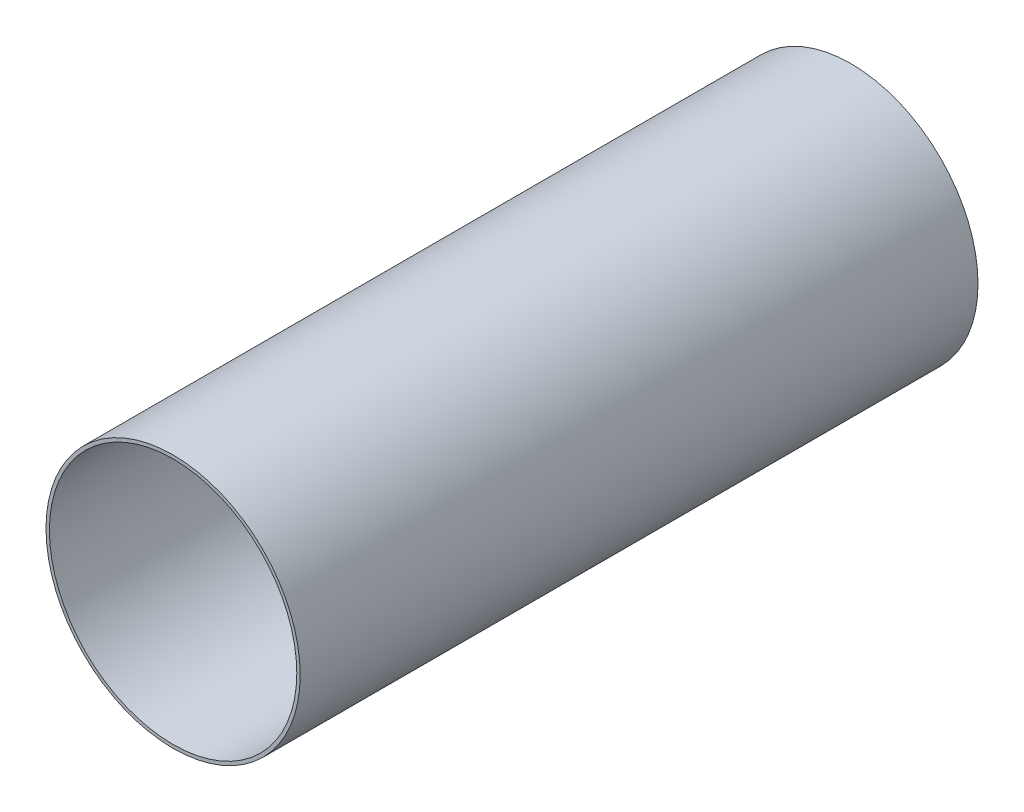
ISO-10303-21;
HEADER;
FILE_DESCRIPTION(('STEP AP214'),'2;1');
FILE_NAME('part.step','',(''),(''),'','','');
FILE_SCHEMA(('AUTOMOTIVE_DESIGN { 1 0 10303 214 1 1 1 1 }'));
ENDSEC;
DATA;
#1=APPLICATION_CONTEXT('core data for automotive mechanical design processes');
#2=APPLICATION_PROTOCOL_DEFINITION('international standard','automotive_design',2000,#1);
#3=PRODUCT_CONTEXT('',#1,'mechanical');
#4=PRODUCT('Part','Part','',(#3));
#5=PRODUCT_RELATED_PRODUCT_CATEGORY('part','',(#4));
#6=PRODUCT_DEFINITION_FORMATION('','',#4);
#7=PRODUCT_DEFINITION_CONTEXT('part definition',#1,'design');
#8=PRODUCT_DEFINITION('design','',#6,#7);
#9=PRODUCT_DEFINITION_SHAPE('','',#8);
#10=(LENGTH_UNIT() NAMED_UNIT(*) SI_UNIT(.MILLI.,.METRE.));
#11=(NAMED_UNIT(*) PLANE_ANGLE_UNIT() SI_UNIT($,.RADIAN.));
#12=(NAMED_UNIT(*) SI_UNIT($,.STERADIAN.) SOLID_ANGLE_UNIT());
#13=UNCERTAINTY_MEASURE_WITH_UNIT(LENGTH_MEASURE(1.E-05),#10,'distance_accuracy_value','');
#14=(GEOMETRIC_REPRESENTATION_CONTEXT(3) GLOBAL_UNCERTAINTY_ASSIGNED_CONTEXT((#13)) GLOBAL_UNIT_ASSIGNED_CONTEXT((#10,
#11,#12)) REPRESENTATION_CONTEXT('',''));
#15=CARTESIAN_POINT('',(0.,0.,0.));
#16=DIRECTION('',(0.,0.,1.));
#17=DIRECTION('',(1.,0.,0.));
#18=AXIS2_PLACEMENT_3D('',#15,#16,#17);
#19=CARTESIAN_POINT('',(0.,0.,400.));
#20=DIRECTION('',(0.,0.,1.));
#21=DIRECTION('',(1.,0.,0.));
#22=AXIS2_PLACEMENT_3D('',#19,#20,#21);
#23=PLANE('',#22);
#24=CARTESIAN_POINT('',(0.,0.,400.));
#25=DIRECTION('',(0.,0.,1.));
#26=DIRECTION('',(1.,0.,0.));
#27=AXIS2_PLACEMENT_3D('',#24,#25,#26);
#28=CIRCLE('',#27,73.);
#29=CARTESIAN_POINT('',(73.,0.,400.));
#30=VERTEX_POINT('',#29);
#31=EDGE_CURVE('E24',#30,#30,#28,.T.);
#32=ORIENTED_EDGE('',*,*,#31,.F.);
#33=EDGE_LOOP('',(#32));
#34=FACE_BOUND('',#33,.T.);
#35=CARTESIAN_POINT('',(0.,0.,400.));
#36=DIRECTION('',(0.,0.,1.));
#37=DIRECTION('',(1.,0.,0.));
#38=AXIS2_PLACEMENT_3D('',#35,#36,#37);
#39=CIRCLE('',#38,75.);
#40=CARTESIAN_POINT('',(75.,0.,400.));
#41=VERTEX_POINT('',#40);
#42=EDGE_CURVE('E57',#41,#41,#39,.T.);
#43=ORIENTED_EDGE('',*,*,#42,.T.);
#44=EDGE_LOOP('',(#43));
#45=FACE_BOUND('',#44,.T.);
#46=ADVANCED_FACE('F16',(#34,#45),#23,.T.);
#47=CARTESIAN_POINT('',(0.,0.,0.));
#48=DIRECTION('',(0.,0.,1.));
#49=DIRECTION('',(1.,0.,0.));
#50=AXIS2_PLACEMENT_3D('',#47,#48,#49);
#51=PLANE('',#50);
#52=CARTESIAN_POINT('',(0.,0.,0.));
#53=DIRECTION('',(0.,0.,1.));
#54=DIRECTION('',(1.,0.,0.));
#55=AXIS2_PLACEMENT_3D('',#52,#53,#54);
#56=CIRCLE('',#55,73.);
#57=CARTESIAN_POINT('',(73.,0.,0.));
#58=VERTEX_POINT('',#57);
#59=EDGE_CURVE('E10',#58,#58,#56,.T.);
#60=ORIENTED_EDGE('',*,*,#59,.T.);
#61=EDGE_LOOP('',(#60));
#62=FACE_BOUND('',#61,.T.);
#63=CARTESIAN_POINT('',(0.,0.,0.));
#64=DIRECTION('',(0.,0.,1.));
#65=DIRECTION('',(1.,0.,0.));
#66=AXIS2_PLACEMENT_3D('',#63,#64,#65);
#67=CIRCLE('',#66,75.);
#68=CARTESIAN_POINT('',(75.,0.,0.));
#69=VERTEX_POINT('',#68);
#70=EDGE_CURVE('E56',#69,#69,#67,.T.);
#71=ORIENTED_EDGE('',*,*,#70,.F.);
#72=EDGE_LOOP('',(#71));
#73=FACE_BOUND('',#72,.T.);
#74=ADVANCED_FACE('F72',(#62,#73),#51,.F.);
#75=CARTESIAN_POINT('',(0.,0.,0.));
#76=DIRECTION('',(0.,0.,-1.));
#77=DIRECTION('',(1.,0.,0.));
#78=AXIS2_PLACEMENT_3D('',#75,#76,#77);
#79=CYLINDRICAL_SURFACE('',#78,73.);
#80=DIRECTION('',(0.,0.,1.));
#81=VECTOR('',#80,1.);
#82=CARTESIAN_POINT('',(73.,0.,0.));
#83=LINE('',#82,#81);
#84=EDGE_CURVE('E63',#58,#30,#83,.T.);
#85=ORIENTED_EDGE('',*,*,#84,.T.);
#86=ORIENTED_EDGE('',*,*,#31,.T.);
#87=ORIENTED_EDGE('',*,*,#84,.F.);
#88=ORIENTED_EDGE('',*,*,#59,.F.);
#89=EDGE_LOOP('',(#85,#86,#87,#88));
#90=FACE_BOUND('',#89,.T.);
#91=ADVANCED_FACE('F70',(#90),#79,.F.);
#92=CARTESIAN_POINT('',(0.,0.,0.));
#93=DIRECTION('',(0.,0.,-1.));
#94=DIRECTION('',(1.,0.,0.));
#95=AXIS2_PLACEMENT_3D('',#92,#93,#94);
#96=CYLINDRICAL_SURFACE('',#95,75.);
#97=ORIENTED_EDGE('',*,*,#70,.T.);
#98=DIRECTION('',(0.,0.,1.));
#99=VECTOR('',#98,1.);
#100=CARTESIAN_POINT('',(75.,0.,0.));
#101=LINE('',#100,#99);
#102=EDGE_CURVE('E53',#69,#41,#101,.T.);
#103=ORIENTED_EDGE('',*,*,#102,.T.);
#104=ORIENTED_EDGE('',*,*,#42,.F.);
#105=ORIENTED_EDGE('',*,*,#102,.F.);
#106=EDGE_LOOP('',(#97,#103,#104,#105));
#107=FACE_BOUND('',#106,.T.);
#108=ADVANCED_FACE('F54',(#107),#96,.T.);
#109=CLOSED_SHELL('',(#46,#74,#91,#108));
#110=MANIFOLD_SOLID_BREP('B1',#109);
#111=ADVANCED_BREP_SHAPE_REPRESENTATION('',(#18,#110),#14);
#112=SHAPE_DEFINITION_REPRESENTATION(#9,#111);
ENDSEC;
END-ISO-10303-21;
